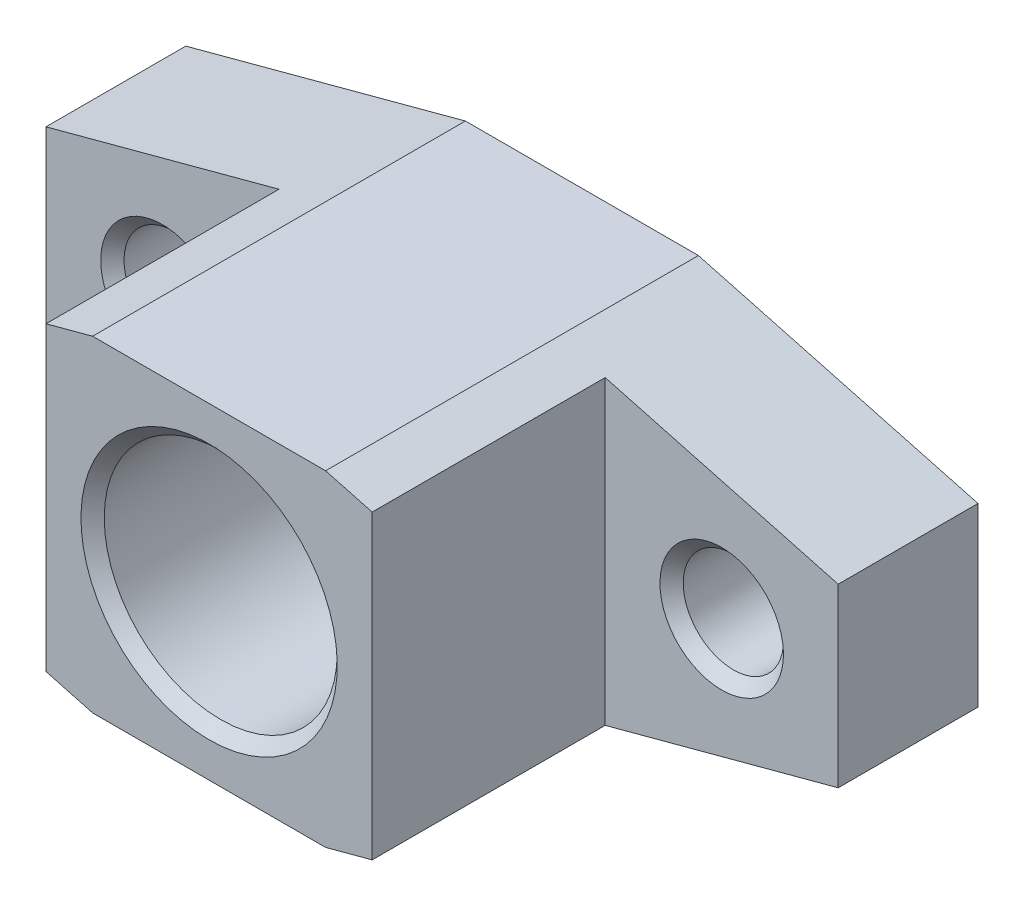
ISO-10303-21;
HEADER;
FILE_DESCRIPTION(('STEP AP214'),'2;1');
FILE_NAME('part.step','',(''),(''),'','','');
FILE_SCHEMA(('AUTOMOTIVE_DESIGN { 1 0 10303 214 1 1 1 1 }'));
ENDSEC;
DATA;
#1=APPLICATION_CONTEXT('core data for automotive mechanical design processes');
#2=APPLICATION_PROTOCOL_DEFINITION('international standard','automotive_design',2000,#1);
#3=PRODUCT_CONTEXT('',#1,'mechanical');
#4=PRODUCT('Part','Part','',(#3));
#5=PRODUCT_RELATED_PRODUCT_CATEGORY('part','',(#4));
#6=PRODUCT_DEFINITION_FORMATION('','',#4);
#7=PRODUCT_DEFINITION_CONTEXT('part definition',#1,'design');
#8=PRODUCT_DEFINITION('design','',#6,#7);
#9=PRODUCT_DEFINITION_SHAPE('','',#8);
#10=(LENGTH_UNIT() NAMED_UNIT(*) SI_UNIT(.MILLI.,.METRE.));
#11=(NAMED_UNIT(*) PLANE_ANGLE_UNIT() SI_UNIT($,.RADIAN.));
#12=(NAMED_UNIT(*) SI_UNIT($,.STERADIAN.) SOLID_ANGLE_UNIT());
#13=UNCERTAINTY_MEASURE_WITH_UNIT(LENGTH_MEASURE(1.E-05),#10,'distance_accuracy_value','');
#14=(GEOMETRIC_REPRESENTATION_CONTEXT(3) GLOBAL_UNCERTAINTY_ASSIGNED_CONTEXT((#13)) GLOBAL_UNIT_ASSIGNED_CONTEXT((#10,
#11,#12)) REPRESENTATION_CONTEXT('',''));
#15=CARTESIAN_POINT('',(0.,0.,0.));
#16=DIRECTION('',(0.,0.,1.));
#17=DIRECTION('',(1.,0.,0.));
#18=AXIS2_PLACEMENT_3D('',#15,#16,#17);
#19=CARTESIAN_POINT('',(-5.,3.78460969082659,6.));
#20=DIRECTION('',(0.,0.,1.));
#21=DIRECTION('',(0.,-1.,0.));
#22=AXIS2_PLACEMENT_3D('',#19,#20,#21);
#23=PLANE('',#22);
#24=CARTESIAN_POINT('',(24.,0.,6.));
#25=DIRECTION('',(0.,0.,1.));
#26=DIRECTION('',(0.,-1.,0.));
#27=AXIS2_PLACEMENT_3D('',#24,#25,#26);
#28=CIRCLE('',#27,2.65);
#29=CARTESIAN_POINT('',(24.,-2.65000000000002,5.99999999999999));
#30=VERTEX_POINT('',#29);
#31=EDGE_CURVE('E204',#30,#30,#28,.F.);
#32=ORIENTED_EDGE('',*,*,#31,.T.);
#33=EDGE_LOOP('',(#32));
#34=FACE_BOUND('',#33,.T.);
#35=DIRECTION('',(-0.96592582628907,0.258819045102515,0.));
#36=VECTOR('',#35,1.);
#37=CARTESIAN_POINT('',(17.,7.,6.));
#38=LINE('',#37,#36);
#39=CARTESIAN_POINT('',(29.,3.7846096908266,6.));
#40=VERTEX_POINT('',#39);
#41=CARTESIAN_POINT('',(19.,6.46410161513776,6.));
#42=VERTEX_POINT('',#41);
#43=EDGE_CURVE('E29',#40,#42,#38,.T.);
#44=ORIENTED_EDGE('',*,*,#43,.T.);
#45=DIRECTION('',(0.,-1.,0.));
#46=VECTOR('',#45,1.);
#47=CARTESIAN_POINT('',(19.,3.78460969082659,6.));
#48=LINE('',#47,#46);
#49=CARTESIAN_POINT('',(19.,-6.46410161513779,6.));
#50=VERTEX_POINT('',#49);
#51=EDGE_CURVE('E33',#42,#50,#48,.T.);
#52=ORIENTED_EDGE('',*,*,#51,.T.);
#53=DIRECTION('',(0.96592582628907,0.258819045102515,0.));
#54=VECTOR('',#53,1.);
#55=CARTESIAN_POINT('',(29.,-3.78460969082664,6.));
#56=LINE('',#55,#54);
#57=CARTESIAN_POINT('',(29.,-3.78460969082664,6.));
#58=VERTEX_POINT('',#57);
#59=EDGE_CURVE('E125',#50,#58,#56,.T.);
#60=ORIENTED_EDGE('',*,*,#59,.T.);
#61=DIRECTION('',(0.,1.,0.));
#62=VECTOR('',#61,1.);
#63=CARTESIAN_POINT('',(29.,3.7846096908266,6.));
#64=LINE('',#63,#62);
#65=EDGE_CURVE('E143',#58,#40,#64,.T.);
#66=ORIENTED_EDGE('',*,*,#65,.T.);
#67=EDGE_LOOP('',(#44,#52,#60,#66));
#68=FACE_BOUND('',#67,.T.);
#69=ADVANCED_FACE('F14',(#34,#68),#23,.T.);
#70=CARTESIAN_POINT('',(0.,0.,6.));
#71=DIRECTION('',(0.,0.,1.));
#72=DIRECTION('',(0.,-1.,0.));
#73=AXIS2_PLACEMENT_3D('',#70,#71,#72);
#74=CIRCLE('',#73,2.65);
#75=CARTESIAN_POINT('',(0.,-2.65000000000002,5.99999999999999));
#76=VERTEX_POINT('',#75);
#77=EDGE_CURVE('E195',#76,#76,#74,.F.);
#78=ORIENTED_EDGE('',*,*,#77,.T.);
#79=EDGE_LOOP('',(#78));
#80=FACE_BOUND('',#79,.T.);
#81=DIRECTION('',(0.96592582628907,-0.258819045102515,0.));
#82=VECTOR('',#81,1.);
#83=CARTESIAN_POINT('',(-5.,-3.78460969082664,6.));
#84=LINE('',#83,#82);
#85=CARTESIAN_POINT('',(-5.,-3.78460969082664,6.));
#86=VERTEX_POINT('',#85);
#87=CARTESIAN_POINT('',(5.,-6.4641016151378,6.));
#88=VERTEX_POINT('',#87);
#89=EDGE_CURVE('E140',#86,#88,#84,.T.);
#90=ORIENTED_EDGE('',*,*,#89,.T.);
#91=DIRECTION('',(0.,1.,0.));
#92=VECTOR('',#91,1.);
#93=CARTESIAN_POINT('',(5.,3.78460969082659,6.));
#94=LINE('',#93,#92);
#95=CARTESIAN_POINT('',(5.,6.46410161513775,6.));
#96=VERTEX_POINT('',#95);
#97=EDGE_CURVE('E126',#88,#96,#94,.T.);
#98=ORIENTED_EDGE('',*,*,#97,.T.);
#99=DIRECTION('',(-0.96592582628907,-0.258819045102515,0.));
#100=VECTOR('',#99,1.);
#101=CARTESIAN_POINT('',(7.,7.,6.));
#102=LINE('',#101,#100);
#103=CARTESIAN_POINT('',(-5.,3.78460969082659,6.));
#104=VERTEX_POINT('',#103);
#105=EDGE_CURVE('E135',#96,#104,#102,.T.);
#106=ORIENTED_EDGE('',*,*,#105,.T.);
#107=DIRECTION('',(0.,-1.,0.));
#108=VECTOR('',#107,1.);
#109=CARTESIAN_POINT('',(-5.,3.78460969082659,6.));
#110=LINE('',#109,#108);
#111=EDGE_CURVE('E137',#104,#86,#110,.T.);
#112=ORIENTED_EDGE('',*,*,#111,.T.);
#113=EDGE_LOOP('',(#90,#98,#106,#112));
#114=FACE_BOUND('',#113,.T.);
#115=ADVANCED_FACE('F236',(#80,#114),#23,.T.);
#116=CARTESIAN_POINT('',(7.,7.,6.));
#117=DIRECTION('',(0.258819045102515,-0.96592582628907,0.));
#118=DIRECTION('',(0.96592582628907,0.258819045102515,0.));
#119=AXIS2_PLACEMENT_3D('',#116,#117,#118);
#120=PLANE('',#119);
#121=DIRECTION('',(-0.96592582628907,-0.258819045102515,0.));
#122=VECTOR('',#121,1.);
#123=CARTESIAN_POINT('',(7.,7.,0.));
#124=LINE('',#123,#122);
#125=CARTESIAN_POINT('',(7.,7.,0.));
#126=VERTEX_POINT('',#125);
#127=CARTESIAN_POINT('',(-5.,3.78460969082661,0.));
#128=VERTEX_POINT('',#127);
#129=EDGE_CURVE('E134',#126,#128,#124,.T.);
#130=ORIENTED_EDGE('',*,*,#129,.T.);
#131=DIRECTION('',(0.,0.,-1.));
#132=VECTOR('',#131,1.);
#133=CARTESIAN_POINT('',(-5.,3.78460969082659,6.));
#134=LINE('',#133,#132);
#135=EDGE_CURVE('E180',#104,#128,#134,.T.);
#136=ORIENTED_EDGE('',*,*,#135,.F.);
#137=ORIENTED_EDGE('',*,*,#105,.F.);
#138=DIRECTION('',(0.,0.,-1.));
#139=VECTOR('',#138,1.);
#140=CARTESIAN_POINT('',(5.,6.46410161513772,16.));
#141=LINE('',#140,#139);
#142=CARTESIAN_POINT('',(5.,6.46410161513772,16.));
#143=VERTEX_POINT('',#142);
#144=EDGE_CURVE('E129',#143,#96,#141,.T.);
#145=ORIENTED_EDGE('',*,*,#144,.F.);
#146=DIRECTION('',(-0.96592582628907,-0.258819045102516,0.));
#147=VECTOR('',#146,1.);
#148=CARTESIAN_POINT('',(7.,7.,16.));
#149=LINE('',#148,#147);
#150=CARTESIAN_POINT('',(7.,7.,16.));
#151=VERTEX_POINT('',#150);
#152=EDGE_CURVE('E335',#151,#143,#149,.T.);
#153=ORIENTED_EDGE('',*,*,#152,.F.);
#154=DIRECTION('',(0.,0.,-1.));
#155=VECTOR('',#154,1.);
#156=CARTESIAN_POINT('',(7.,7.,6.));
#157=LINE('',#156,#155);
#158=EDGE_CURVE('E146',#151,#126,#157,.T.);
#159=ORIENTED_EDGE('',*,*,#158,.T.);
#160=EDGE_LOOP('',(#130,#136,#137,#145,#153,#159));
#161=FACE_BOUND('',#160,.T.);
#162=ADVANCED_FACE('F243',(#161),#120,.F.);
#163=CARTESIAN_POINT('',(-5.,3.78460969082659,6.));
#164=DIRECTION('',(1.,0.,0.));
#165=DIRECTION('',(0.,1.,0.));
#166=AXIS2_PLACEMENT_3D('',#163,#164,#165);
#167=PLANE('',#166);
#168=DIRECTION('',(0.,-1.,0.));
#169=VECTOR('',#168,1.);
#170=CARTESIAN_POINT('',(-5.,3.78460969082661,0.));
#171=LINE('',#170,#169);
#172=CARTESIAN_POINT('',(-5.,-3.78460969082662,0.));
#173=VERTEX_POINT('',#172);
#174=EDGE_CURVE('E148',#128,#173,#171,.T.);
#175=ORIENTED_EDGE('',*,*,#174,.T.);
#176=DIRECTION('',(0.,0.,-1.));
#177=VECTOR('',#176,1.);
#178=CARTESIAN_POINT('',(-5.,-3.78460969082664,6.));
#179=LINE('',#178,#177);
#180=EDGE_CURVE('E177',#86,#173,#179,.T.);
#181=ORIENTED_EDGE('',*,*,#180,.F.);
#182=ORIENTED_EDGE('',*,*,#111,.F.);
#183=ORIENTED_EDGE('',*,*,#135,.T.);
#184=EDGE_LOOP('',(#175,#181,#182,#183));
#185=FACE_BOUND('',#184,.T.);
#186=ADVANCED_FACE('F271',(#185),#167,.F.);
#187=CARTESIAN_POINT('',(-5.,-3.78460969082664,6.));
#188=DIRECTION('',(0.258819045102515,0.96592582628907,0.));
#189=DIRECTION('',(-0.96592582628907,0.258819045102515,0.));
#190=AXIS2_PLACEMENT_3D('',#187,#188,#189);
#191=PLANE('',#190);
#192=DIRECTION('',(0.,0.,-1.));
#193=VECTOR('',#192,1.);
#194=CARTESIAN_POINT('',(7.,-7.,6.));
#195=LINE('',#194,#193);
#196=CARTESIAN_POINT('',(7.,-7.,16.));
#197=VERTEX_POINT('',#196);
#198=CARTESIAN_POINT('',(7.,-7.,0.));
#199=VERTEX_POINT('',#198);
#200=EDGE_CURVE('E174',#197,#199,#195,.T.);
#201=ORIENTED_EDGE('',*,*,#200,.F.);
#202=DIRECTION('',(0.96592582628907,-0.258819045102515,0.));
#203=VECTOR('',#202,1.);
#204=CARTESIAN_POINT('',(5.,-6.46410161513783,16.));
#205=LINE('',#204,#203);
#206=CARTESIAN_POINT('',(5.,-6.46410161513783,16.));
#207=VERTEX_POINT('',#206);
#208=EDGE_CURVE('E328',#207,#197,#205,.T.);
#209=ORIENTED_EDGE('',*,*,#208,.F.);
#210=DIRECTION('',(0.,0.,-1.));
#211=VECTOR('',#210,1.);
#212=CARTESIAN_POINT('',(5.,-6.46410161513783,16.));
#213=LINE('',#212,#211);
#214=EDGE_CURVE('E322',#207,#88,#213,.T.);
#215=ORIENTED_EDGE('',*,*,#214,.T.);
#216=ORIENTED_EDGE('',*,*,#89,.F.);
#217=ORIENTED_EDGE('',*,*,#180,.T.);
#218=DIRECTION('',(0.96592582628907,-0.258819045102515,0.));
#219=VECTOR('',#218,1.);
#220=CARTESIAN_POINT('',(-5.,-3.78460969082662,0.));
#221=LINE('',#220,#219);
#222=EDGE_CURVE('E150',#173,#199,#221,.T.);
#223=ORIENTED_EDGE('',*,*,#222,.T.);
#224=EDGE_LOOP('',(#201,#209,#215,#216,#217,#223));
#225=FACE_BOUND('',#224,.T.);
#226=ADVANCED_FACE('F267',(#225),#191,.F.);
#227=CARTESIAN_POINT('',(7.,-7.,6.));
#228=DIRECTION('',(0.,1.,0.));
#229=DIRECTION('',(-1.,0.,0.));
#230=AXIS2_PLACEMENT_3D('',#227,#228,#229);
#231=PLANE('',#230);
#232=DIRECTION('',(1.,0.,0.));
#233=VECTOR('',#232,1.);
#234=CARTESIAN_POINT('',(7.,-7.,0.));
#235=LINE('',#234,#233);
#236=CARTESIAN_POINT('',(17.,-7.,0.));
#237=VERTEX_POINT('',#236);
#238=EDGE_CURVE('E152',#199,#237,#235,.T.);
#239=ORIENTED_EDGE('',*,*,#238,.T.);
#240=DIRECTION('',(0.,0.,-1.));
#241=VECTOR('',#240,1.);
#242=CARTESIAN_POINT('',(17.,-7.,6.));
#243=LINE('',#242,#241);
#244=CARTESIAN_POINT('',(17.,-7.,16.));
#245=VERTEX_POINT('',#244);
#246=EDGE_CURVE('E172',#245,#237,#243,.T.);
#247=ORIENTED_EDGE('',*,*,#246,.F.);
#248=DIRECTION('',(1.,0.,0.));
#249=VECTOR('',#248,1.);
#250=CARTESIAN_POINT('',(17.,-7.,16.));
#251=LINE('',#250,#249);
#252=EDGE_CURVE('E119',#197,#245,#251,.T.);
#253=ORIENTED_EDGE('',*,*,#252,.F.);
#254=ORIENTED_EDGE('',*,*,#200,.T.);
#255=EDGE_LOOP('',(#239,#247,#253,#254));
#256=FACE_BOUND('',#255,.T.);
#257=ADVANCED_FACE('F264',(#256),#231,.F.);
#258=CARTESIAN_POINT('',(29.,-3.78460969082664,6.));
#259=DIRECTION('',(-0.258819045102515,0.96592582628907,0.));
#260=DIRECTION('',(-0.96592582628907,-0.258819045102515,0.));
#261=AXIS2_PLACEMENT_3D('',#258,#259,#260);
#262=PLANE('',#261);
#263=DIRECTION('',(0.96592582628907,0.258819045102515,0.));
#264=VECTOR('',#263,1.);
#265=CARTESIAN_POINT('',(29.,-3.78460969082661,0.));
#266=LINE('',#265,#264);
#267=CARTESIAN_POINT('',(29.,-3.78460969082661,0.));
#268=VERTEX_POINT('',#267);
#269=EDGE_CURVE('E154',#237,#268,#266,.T.);
#270=ORIENTED_EDGE('',*,*,#269,.T.);
#271=DIRECTION('',(0.,0.,-1.));
#272=VECTOR('',#271,1.);
#273=CARTESIAN_POINT('',(29.,-3.78460969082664,6.));
#274=LINE('',#273,#272);
#275=EDGE_CURVE('E169',#58,#268,#274,.T.);
#276=ORIENTED_EDGE('',*,*,#275,.F.);
#277=ORIENTED_EDGE('',*,*,#59,.F.);
#278=DIRECTION('',(0.,0.,-1.));
#279=VECTOR('',#278,1.);
#280=CARTESIAN_POINT('',(19.,-6.46410161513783,16.));
#281=LINE('',#280,#279);
#282=CARTESIAN_POINT('',(19.,-6.46410161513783,16.));
#283=VERTEX_POINT('',#282);
#284=EDGE_CURVE('E105',#283,#50,#281,.T.);
#285=ORIENTED_EDGE('',*,*,#284,.F.);
#286=DIRECTION('',(0.96592582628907,0.258819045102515,0.));
#287=VECTOR('',#286,1.);
#288=CARTESIAN_POINT('',(17.,-7.,16.));
#289=LINE('',#288,#287);
#290=EDGE_CURVE('E112',#245,#283,#289,.T.);
#291=ORIENTED_EDGE('',*,*,#290,.F.);
#292=ORIENTED_EDGE('',*,*,#246,.T.);
#293=EDGE_LOOP('',(#270,#276,#277,#285,#291,#292));
#294=FACE_BOUND('',#293,.T.);
#295=ADVANCED_FACE('F123',(#294),#262,.F.);
#296=CARTESIAN_POINT('',(29.,3.7846096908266,6.));
#297=DIRECTION('',(-1.,0.,0.));
#298=DIRECTION('',(0.,-1.,0.));
#299=AXIS2_PLACEMENT_3D('',#296,#297,#298);
#300=PLANE('',#299);
#301=DIRECTION('',(0.,1.,0.));
#302=VECTOR('',#301,1.);
#303=CARTESIAN_POINT('',(29.,3.78460969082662,0.));
#304=LINE('',#303,#302);
#305=CARTESIAN_POINT('',(29.,3.78460969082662,0.));
#306=VERTEX_POINT('',#305);
#307=EDGE_CURVE('E156',#268,#306,#304,.T.);
#308=ORIENTED_EDGE('',*,*,#307,.T.);
#309=DIRECTION('',(0.,0.,-1.));
#310=VECTOR('',#309,1.);
#311=CARTESIAN_POINT('',(29.,3.7846096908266,6.));
#312=LINE('',#311,#310);
#313=EDGE_CURVE('E166',#40,#306,#312,.T.);
#314=ORIENTED_EDGE('',*,*,#313,.F.);
#315=ORIENTED_EDGE('',*,*,#65,.F.);
#316=ORIENTED_EDGE('',*,*,#275,.T.);
#317=EDGE_LOOP('',(#308,#314,#315,#316));
#318=FACE_BOUND('',#317,.T.);
#319=ADVANCED_FACE('F257',(#318),#300,.F.);
#320=CARTESIAN_POINT('',(17.,7.,6.));
#321=DIRECTION('',(-0.258819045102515,-0.96592582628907,0.));
#322=DIRECTION('',(0.96592582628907,-0.258819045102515,0.));
#323=AXIS2_PLACEMENT_3D('',#320,#321,#322);
#324=PLANE('',#323);
#325=DIRECTION('',(0.,0.,-1.));
#326=VECTOR('',#325,1.);
#327=CARTESIAN_POINT('',(17.,7.,6.));
#328=LINE('',#327,#326);
#329=CARTESIAN_POINT('',(17.,7.,16.));
#330=VERTEX_POINT('',#329);
#331=CARTESIAN_POINT('',(17.,7.,0.));
#332=VERTEX_POINT('',#331);
#333=EDGE_CURVE('E163',#330,#332,#328,.T.);
#334=ORIENTED_EDGE('',*,*,#333,.F.);
#335=DIRECTION('',(-0.96592582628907,0.258819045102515,0.));
#336=VECTOR('',#335,1.);
#337=CARTESIAN_POINT('',(19.,6.46410161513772,16.));
#338=LINE('',#337,#336);
#339=CARTESIAN_POINT('',(19.,6.46410161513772,16.));
#340=VERTEX_POINT('',#339);
#341=EDGE_CURVE('E111',#340,#330,#338,.T.);
#342=ORIENTED_EDGE('',*,*,#341,.F.);
#343=DIRECTION('',(0.,0.,-1.));
#344=VECTOR('',#343,1.);
#345=CARTESIAN_POINT('',(19.,6.46410161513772,16.));
#346=LINE('',#345,#344);
#347=EDGE_CURVE('E107',#340,#42,#346,.T.);
#348=ORIENTED_EDGE('',*,*,#347,.T.);
#349=ORIENTED_EDGE('',*,*,#43,.F.);
#350=ORIENTED_EDGE('',*,*,#313,.T.);
#351=DIRECTION('',(-0.96592582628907,0.258819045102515,0.));
#352=VECTOR('',#351,1.);
#353=CARTESIAN_POINT('',(17.,7.,0.));
#354=LINE('',#353,#352);
#355=EDGE_CURVE('E158',#306,#332,#354,.T.);
#356=ORIENTED_EDGE('',*,*,#355,.T.);
#357=EDGE_LOOP('',(#334,#342,#348,#349,#350,#356));
#358=FACE_BOUND('',#357,.T.);
#359=ADVANCED_FACE('F253',(#358),#324,.F.);
#360=CARTESIAN_POINT('',(7.,7.,6.));
#361=DIRECTION('',(0.,-1.,0.));
#362=DIRECTION('',(1.,0.,0.));
#363=AXIS2_PLACEMENT_3D('',#360,#361,#362);
#364=PLANE('',#363);
#365=DIRECTION('',(-1.,0.,0.));
#366=VECTOR('',#365,1.);
#367=CARTESIAN_POINT('',(7.,7.,0.));
#368=LINE('',#367,#366);
#369=EDGE_CURVE('E138',#332,#126,#368,.T.);
#370=ORIENTED_EDGE('',*,*,#369,.T.);
#371=ORIENTED_EDGE('',*,*,#158,.F.);
#372=DIRECTION('',(-1.,0.,0.));
#373=VECTOR('',#372,1.);
#374=CARTESIAN_POINT('',(17.,7.,16.));
#375=LINE('',#374,#373);
#376=EDGE_CURVE('E337',#330,#151,#375,.T.);
#377=ORIENTED_EDGE('',*,*,#376,.F.);
#378=ORIENTED_EDGE('',*,*,#333,.T.);
#379=EDGE_LOOP('',(#370,#371,#377,#378));
#380=FACE_BOUND('',#379,.T.);
#381=ADVANCED_FACE('F250',(#380),#364,.F.);
#382=CARTESIAN_POINT('',(-5.,3.78460969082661,0.));
#383=DIRECTION('',(0.,0.,1.));
#384=DIRECTION('',(0.,-1.,0.));
#385=AXIS2_PLACEMENT_3D('',#382,#383,#384);
#386=PLANE('',#385);
#387=CARTESIAN_POINT('',(0.,0.,0.));
#388=DIRECTION('',(0.,0.,1.));
#389=DIRECTION('',(0.,-1.,0.));
#390=AXIS2_PLACEMENT_3D('',#387,#388,#389);
#391=CIRCLE('',#390,2.65);
#392=CARTESIAN_POINT('',(0.,-2.65,0.));
#393=VERTEX_POINT('',#392);
#394=EDGE_CURVE('E22',#393,#393,#391,.T.);
#395=ORIENTED_EDGE('',*,*,#394,.T.);
#396=EDGE_LOOP('',(#395));
#397=FACE_BOUND('',#396,.T.);
#398=CARTESIAN_POINT('',(24.,0.,0.));
#399=DIRECTION('',(0.,0.,1.));
#400=DIRECTION('',(0.,-1.,0.));
#401=AXIS2_PLACEMENT_3D('',#398,#399,#400);
#402=CIRCLE('',#401,2.65);
#403=CARTESIAN_POINT('',(24.,-2.65,0.));
#404=VERTEX_POINT('',#403);
#405=EDGE_CURVE('E210',#404,#404,#402,.T.);
#406=ORIENTED_EDGE('',*,*,#405,.T.);
#407=EDGE_LOOP('',(#406));
#408=FACE_BOUND('',#407,.T.);
#409=CARTESIAN_POINT('',(12.,0.,0.));
#410=DIRECTION('',(0.,0.,1.));
#411=DIRECTION('',(0.,-1.,0.));
#412=AXIS2_PLACEMENT_3D('',#409,#410,#411);
#413=CIRCLE('',#412,5.5);
#414=CARTESIAN_POINT('',(12.,-5.5,0.));
#415=VERTEX_POINT('',#414);
#416=EDGE_CURVE('E207',#415,#415,#413,.T.);
#417=ORIENTED_EDGE('',*,*,#416,.T.);
#418=EDGE_LOOP('',(#417));
#419=FACE_BOUND('',#418,.T.);
#420=ORIENTED_EDGE('',*,*,#369,.F.);
#421=ORIENTED_EDGE('',*,*,#355,.F.);
#422=ORIENTED_EDGE('',*,*,#307,.F.);
#423=ORIENTED_EDGE('',*,*,#269,.F.);
#424=ORIENTED_EDGE('',*,*,#238,.F.);
#425=ORIENTED_EDGE('',*,*,#222,.F.);
#426=ORIENTED_EDGE('',*,*,#174,.F.);
#427=ORIENTED_EDGE('',*,*,#129,.F.);
#428=EDGE_LOOP('',(#420,#421,#422,#423,#424,#425,#426,#427));
#429=FACE_BOUND('',#428,.T.);
#430=ADVANCED_FACE('F215',(#397,#408,#419,#429),#386,.F.);
#431=CARTESIAN_POINT('',(19.,-6.46410161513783,16.));
#432=DIRECTION('',(-1.,0.,0.));
#433=DIRECTION('',(0.,-1.,0.));
#434=AXIS2_PLACEMENT_3D('',#431,#432,#433);
#435=PLANE('',#434);
#436=ORIENTED_EDGE('',*,*,#51,.F.);
#437=ORIENTED_EDGE('',*,*,#347,.F.);
#438=DIRECTION('',(0.,1.,0.));
#439=VECTOR('',#438,1.);
#440=CARTESIAN_POINT('',(19.,-6.46410161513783,16.));
#441=LINE('',#440,#439);
#442=EDGE_CURVE('E101',#283,#340,#441,.T.);
#443=ORIENTED_EDGE('',*,*,#442,.F.);
#444=ORIENTED_EDGE('',*,*,#284,.T.);
#445=EDGE_LOOP('',(#436,#437,#443,#444));
#446=FACE_BOUND('',#445,.T.);
#447=ADVANCED_FACE('F103',(#446),#435,.F.);
#448=CARTESIAN_POINT('',(5.,-6.46410161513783,16.));
#449=DIRECTION('',(1.,0.,0.));
#450=DIRECTION('',(0.,1.,0.));
#451=AXIS2_PLACEMENT_3D('',#448,#449,#450);
#452=PLANE('',#451);
#453=ORIENTED_EDGE('',*,*,#97,.F.);
#454=ORIENTED_EDGE('',*,*,#214,.F.);
#455=DIRECTION('',(0.,-1.,0.));
#456=VECTOR('',#455,1.);
#457=CARTESIAN_POINT('',(5.,-6.46410161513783,16.));
#458=LINE('',#457,#456);
#459=EDGE_CURVE('E333',#143,#207,#458,.T.);
#460=ORIENTED_EDGE('',*,*,#459,.F.);
#461=ORIENTED_EDGE('',*,*,#144,.T.);
#462=EDGE_LOOP('',(#453,#454,#460,#461));
#463=FACE_BOUND('',#462,.T.);
#464=ADVANCED_FACE('F309',(#463),#452,.F.);
#465=CARTESIAN_POINT('',(5.,-10.2153903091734,16.));
#466=DIRECTION('',(0.,0.,1.));
#467=DIRECTION('',(0.,-1.,0.));
#468=AXIS2_PLACEMENT_3D('',#465,#466,#467);
#469=PLANE('',#468);
#470=CARTESIAN_POINT('',(12.,0.,16.));
#471=DIRECTION('',(0.,0.,1.));
#472=DIRECTION('',(0.,-1.,0.));
#473=AXIS2_PLACEMENT_3D('',#470,#471,#472);
#474=CIRCLE('',#473,5.5);
#475=CARTESIAN_POINT('',(12.,-5.50000000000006,16.));
#476=VERTEX_POINT('',#475);
#477=EDGE_CURVE('E186',#476,#476,#474,.F.);
#478=ORIENTED_EDGE('',*,*,#477,.T.);
#479=EDGE_LOOP('',(#478));
#480=FACE_BOUND('',#479,.T.);
#481=ORIENTED_EDGE('',*,*,#290,.T.);
#482=ORIENTED_EDGE('',*,*,#442,.T.);
#483=ORIENTED_EDGE('',*,*,#341,.T.);
#484=ORIENTED_EDGE('',*,*,#376,.T.);
#485=ORIENTED_EDGE('',*,*,#152,.T.);
#486=ORIENTED_EDGE('',*,*,#459,.T.);
#487=ORIENTED_EDGE('',*,*,#208,.T.);
#488=ORIENTED_EDGE('',*,*,#252,.T.);
#489=EDGE_LOOP('',(#481,#482,#483,#484,#485,#486,#487,#488));
#490=FACE_BOUND('',#489,.T.);
#491=ADVANCED_FACE('F116',(#480,#490),#469,.T.);
#492=CARTESIAN_POINT('',(24.,0.,6.));
#493=DIRECTION('',(0.,0.,1.));
#494=DIRECTION('',(0.,-1.,0.));
#495=AXIS2_PLACEMENT_3D('',#492,#493,#494);
#496=CYLINDRICAL_SURFACE('',#495,2.15);
#497=CARTESIAN_POINT('',(24.,0.,5.5));
#498=DIRECTION('',(0.,0.,1.));
#499=DIRECTION('',(0.,-1.,0.));
#500=AXIS2_PLACEMENT_3D('',#497,#498,#499);
#501=CIRCLE('',#500,2.15);
#502=CARTESIAN_POINT('',(24.,-2.15000000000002,5.49999999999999));
#503=VERTEX_POINT('',#502);
#504=EDGE_CURVE('E201',#503,#503,#501,.T.);
#505=ORIENTED_EDGE('',*,*,#504,.T.);
#506=EDGE_LOOP('',(#505));
#507=FACE_BOUND('',#506,.T.);
#508=CARTESIAN_POINT('',(24.,0.,0.5));
#509=DIRECTION('',(0.,0.,1.));
#510=DIRECTION('',(0.,-1.,0.));
#511=AXIS2_PLACEMENT_3D('',#508,#509,#510);
#512=CIRCLE('',#511,2.15);
#513=CARTESIAN_POINT('',(24.,-2.15,0.499999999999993));
#514=VERTEX_POINT('',#513);
#515=EDGE_CURVE('E198',#514,#514,#512,.F.);
#516=ORIENTED_EDGE('',*,*,#515,.T.);
#517=EDGE_LOOP('',(#516));
#518=FACE_BOUND('',#517,.T.);
#519=ADVANCED_FACE('F296',(#507,#518),#496,.F.);
#520=CARTESIAN_POINT('',(0.,0.,6.));
#521=DIRECTION('',(0.,0.,1.));
#522=DIRECTION('',(0.,-1.,0.));
#523=AXIS2_PLACEMENT_3D('',#520,#521,#522);
#524=CYLINDRICAL_SURFACE('',#523,2.15);
#525=CARTESIAN_POINT('',(0.,0.,5.5));
#526=DIRECTION('',(0.,0.,1.));
#527=DIRECTION('',(0.,-1.,0.));
#528=AXIS2_PLACEMENT_3D('',#525,#526,#527);
#529=CIRCLE('',#528,2.15);
#530=CARTESIAN_POINT('',(0.,-2.15000000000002,5.49999999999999));
#531=VERTEX_POINT('',#530);
#532=EDGE_CURVE('E192',#531,#531,#529,.T.);
#533=ORIENTED_EDGE('',*,*,#532,.T.);
#534=EDGE_LOOP('',(#533));
#535=FACE_BOUND('',#534,.T.);
#536=CARTESIAN_POINT('',(0.,0.,0.5));
#537=DIRECTION('',(0.,0.,1.));
#538=DIRECTION('',(0.,-1.,0.));
#539=AXIS2_PLACEMENT_3D('',#536,#537,#538);
#540=CIRCLE('',#539,2.15);
#541=CARTESIAN_POINT('',(0.,-2.15,0.499999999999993));
#542=VERTEX_POINT('',#541);
#543=EDGE_CURVE('E189',#542,#542,#540,.F.);
#544=ORIENTED_EDGE('',*,*,#543,.T.);
#545=EDGE_LOOP('',(#544));
#546=FACE_BOUND('',#545,.T.);
#547=ADVANCED_FACE('F293',(#535,#546),#524,.F.);
#548=CARTESIAN_POINT('',(12.,0.,0.));
#549=DIRECTION('',(0.,0.,1.));
#550=DIRECTION('',(0.,-1.,0.));
#551=AXIS2_PLACEMENT_3D('',#548,#549,#550);
#552=CYLINDRICAL_SURFACE('',#551,5.);
#553=CARTESIAN_POINT('',(12.,0.,0.5));
#554=DIRECTION('',(0.,0.,1.));
#555=DIRECTION('',(0.,-1.,0.));
#556=AXIS2_PLACEMENT_3D('',#553,#554,#555);
#557=CIRCLE('',#556,5.);
#558=CARTESIAN_POINT('',(12.,-5.,0.499999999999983));
#559=VERTEX_POINT('',#558);
#560=EDGE_CURVE('E9',#559,#559,#557,.F.);
#561=ORIENTED_EDGE('',*,*,#560,.T.);
#562=EDGE_LOOP('',(#561));
#563=FACE_BOUND('',#562,.T.);
#564=CARTESIAN_POINT('',(12.,0.,15.5));
#565=DIRECTION('',(0.,0.,1.));
#566=DIRECTION('',(0.,-1.,0.));
#567=AXIS2_PLACEMENT_3D('',#564,#565,#566);
#568=CIRCLE('',#567,5.);
#569=CARTESIAN_POINT('',(12.,-5.00000000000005,15.5));
#570=VERTEX_POINT('',#569);
#571=EDGE_CURVE('E183',#570,#570,#568,.T.);
#572=ORIENTED_EDGE('',*,*,#571,.T.);
#573=EDGE_LOOP('',(#572));
#574=FACE_BOUND('',#573,.T.);
#575=ADVANCED_FACE('F282',(#563,#574),#552,.F.);
#576=CARTESIAN_POINT('',(12.,0.,15.5));
#577=DIRECTION('',(0.,0.,1.));
#578=DIRECTION('',(0.,-1.,0.));
#579=AXIS2_PLACEMENT_3D('',#576,#577,#578);
#580=CONICAL_SURFACE('',#579,5.,0.785398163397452);
#581=ORIENTED_EDGE('',*,*,#477,.F.);
#582=EDGE_LOOP('',(#581));
#583=FACE_BOUND('',#582,.T.);
#584=ORIENTED_EDGE('',*,*,#571,.F.);
#585=EDGE_LOOP('',(#584));
#586=FACE_BOUND('',#585,.T.);
#587=ADVANCED_FACE('F279',(#583,#586),#580,.F.);
#588=CARTESIAN_POINT('',(0.,0.,5.5));
#589=DIRECTION('',(0.,0.,1.));
#590=DIRECTION('',(0.,-1.,0.));
#591=AXIS2_PLACEMENT_3D('',#588,#589,#590);
#592=CONICAL_SURFACE('',#591,2.15,0.78539816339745);
#593=ORIENTED_EDGE('',*,*,#77,.F.);
#594=EDGE_LOOP('',(#593));
#595=FACE_BOUND('',#594,.T.);
#596=ORIENTED_EDGE('',*,*,#532,.F.);
#597=EDGE_LOOP('',(#596));
#598=FACE_BOUND('',#597,.T.);
#599=ADVANCED_FACE('F231',(#595,#598),#592,.F.);
#600=CARTESIAN_POINT('',(24.,0.,5.5));
#601=DIRECTION('',(0.,0.,1.));
#602=DIRECTION('',(0.,-1.,0.));
#603=AXIS2_PLACEMENT_3D('',#600,#601,#602);
#604=CONICAL_SURFACE('',#603,2.15,0.78539816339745);
#605=ORIENTED_EDGE('',*,*,#31,.F.);
#606=EDGE_LOOP('',(#605));
#607=FACE_BOUND('',#606,.T.);
#608=ORIENTED_EDGE('',*,*,#504,.F.);
#609=EDGE_LOOP('',(#608));
#610=FACE_BOUND('',#609,.T.);
#611=ADVANCED_FACE('F221',(#607,#610),#604,.F.);
#612=CARTESIAN_POINT('',(0.,0.,0.));
#613=DIRECTION('',(0.,0.,-1.));
#614=DIRECTION('',(0.,1.,0.));
#615=AXIS2_PLACEMENT_3D('',#612,#613,#614);
#616=CONICAL_SURFACE('',#615,2.65,0.785398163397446);
#617=ORIENTED_EDGE('',*,*,#543,.F.);
#618=EDGE_LOOP('',(#617));
#619=FACE_BOUND('',#618,.T.);
#620=ORIENTED_EDGE('',*,*,#394,.F.);
#621=EDGE_LOOP('',(#620));
#622=FACE_BOUND('',#621,.T.);
#623=ADVANCED_FACE('F218',(#619,#622),#616,.F.);
#624=CARTESIAN_POINT('',(24.,0.,0.));
#625=DIRECTION('',(0.,0.,-1.));
#626=DIRECTION('',(0.,1.,0.));
#627=AXIS2_PLACEMENT_3D('',#624,#625,#626);
#628=CONICAL_SURFACE('',#627,2.65,0.785398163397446);
#629=ORIENTED_EDGE('',*,*,#515,.F.);
#630=EDGE_LOOP('',(#629));
#631=FACE_BOUND('',#630,.T.);
#632=ORIENTED_EDGE('',*,*,#405,.F.);
#633=EDGE_LOOP('',(#632));
#634=FACE_BOUND('',#633,.T.);
#635=ADVANCED_FACE('F220',(#631,#634),#628,.F.);
#636=CARTESIAN_POINT('',(12.,0.,0.));
#637=DIRECTION('',(0.,0.,-1.));
#638=DIRECTION('',(0.,1.,0.));
#639=AXIS2_PLACEMENT_3D('',#636,#637,#638);
#640=CONICAL_SURFACE('',#639,5.5,0.785398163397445);
#641=ORIENTED_EDGE('',*,*,#560,.F.);
#642=EDGE_LOOP('',(#641));
#643=FACE_BOUND('',#642,.T.);
#644=ORIENTED_EDGE('',*,*,#416,.F.);
#645=EDGE_LOOP('',(#644));
#646=FACE_BOUND('',#645,.T.);
#647=ADVANCED_FACE('F16',(#643,#646),#640,.F.);
#648=CLOSED_SHELL('',(#69,#115,#162,#186,#226,#257,#295,#319,#359,#381,#430,#447,#464,#491,#519,
#547,#575,#587,#599,#611,#623,#635,#647));
#649=MANIFOLD_SOLID_BREP('B1',#648);
#650=ADVANCED_BREP_SHAPE_REPRESENTATION('',(#18,#649),#14);
#651=SHAPE_DEFINITION_REPRESENTATION(#9,#650);
ENDSEC;
END-ISO-10303-21;
